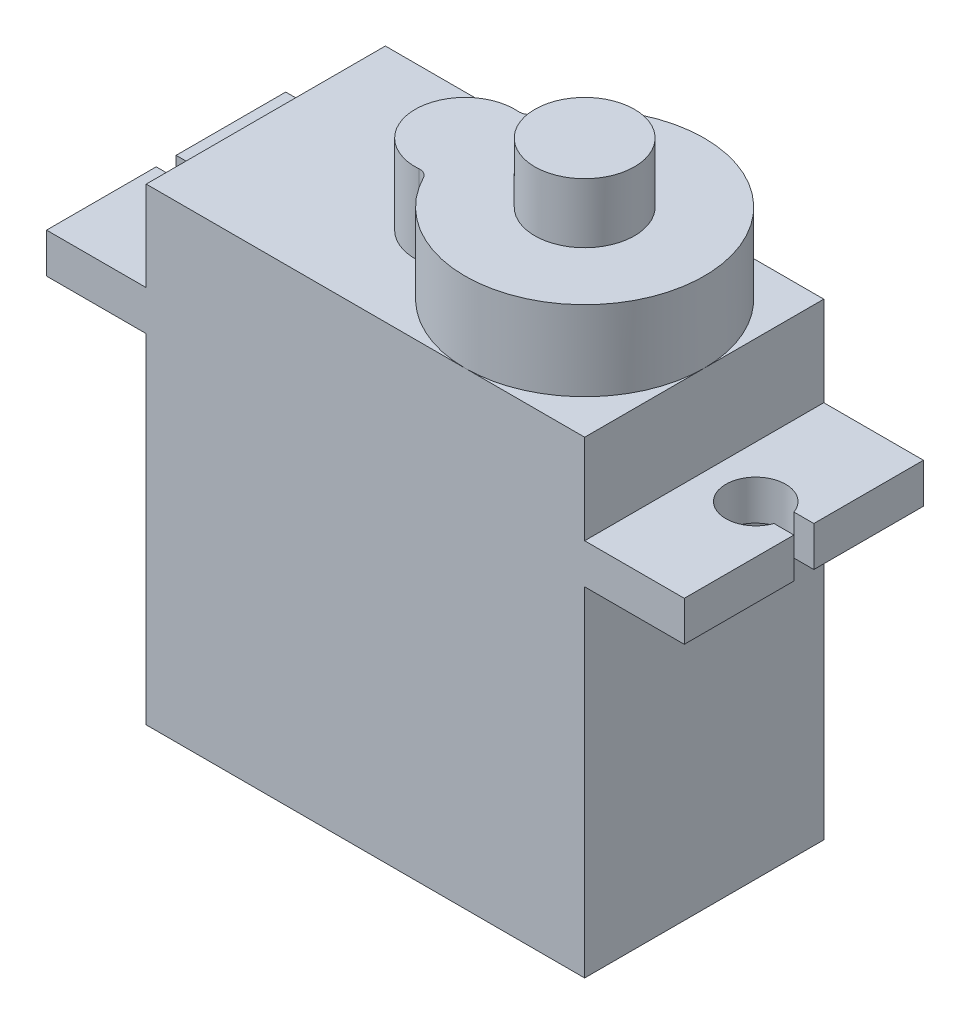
ISO-10303-21;
HEADER;
FILE_DESCRIPTION(('STEP AP214'),'2;1');
FILE_NAME('part.step','',(''),(''),'','','');
FILE_SCHEMA(('AUTOMOTIVE_DESIGN { 1 0 10303 214 1 1 1 1 }'));
ENDSEC;
DATA;
#1=APPLICATION_CONTEXT('core data for automotive mechanical design processes');
#2=APPLICATION_PROTOCOL_DEFINITION('international standard','automotive_design',2000,#1);
#3=PRODUCT_CONTEXT('',#1,'mechanical');
#4=PRODUCT('Part','Part','',(#3));
#5=PRODUCT_RELATED_PRODUCT_CATEGORY('part','',(#4));
#6=PRODUCT_DEFINITION_FORMATION('','',#4);
#7=PRODUCT_DEFINITION_CONTEXT('part definition',#1,'design');
#8=PRODUCT_DEFINITION('design','',#6,#7);
#9=PRODUCT_DEFINITION_SHAPE('','',#8);
#10=(LENGTH_UNIT() NAMED_UNIT(*) SI_UNIT(.MILLI.,.METRE.));
#11=(NAMED_UNIT(*) PLANE_ANGLE_UNIT() SI_UNIT($,.RADIAN.));
#12=(NAMED_UNIT(*) SI_UNIT($,.STERADIAN.) SOLID_ANGLE_UNIT());
#13=UNCERTAINTY_MEASURE_WITH_UNIT(LENGTH_MEASURE(1.E-05),#10,'distance_accuracy_value','');
#14=(GEOMETRIC_REPRESENTATION_CONTEXT(3) GLOBAL_UNCERTAINTY_ASSIGNED_CONTEXT((#13)) GLOBAL_UNIT_ASSIGNED_CONTEXT((#10,
#11,#12)) REPRESENTATION_CONTEXT('',''));
#15=CARTESIAN_POINT('',(0.,0.,0.));
#16=DIRECTION('',(0.,0.,1.));
#17=DIRECTION('',(1.,0.,0.));
#18=AXIS2_PLACEMENT_3D('',#15,#16,#17);
#19=CARTESIAN_POINT('',(0.,23.5,0.));
#20=DIRECTION('',(0.,-1.,0.));
#21=DIRECTION('',(0.,0.,-1.));
#22=AXIS2_PLACEMENT_3D('',#19,#20,#21);
#23=PLANE('',#22);
#24=CARTESIAN_POINT('',(-0.770833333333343,23.5,2.99123430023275));
#25=DIRECTION('',(0.,-1.,0.));
#26=DIRECTION('',(0.,0.,-1.));
#27=AXIS2_PLACEMENT_3D('',#24,#25,#26);
#28=CIRCLE('',#27,0.5);
#29=CARTESIAN_POINT('',(-0.809027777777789,23.5,2.49269525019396));
#30=VERTEX_POINT('',#29);
#31=CARTESIAN_POINT('',(-0.326923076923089,23.5,2.761139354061));
#32=VERTEX_POINT('',#31);
#33=EDGE_CURVE('E50',#30,#32,#28,.T.);
#34=ORIENTED_EDGE('',*,*,#33,.F.);
#35=CARTESIAN_POINT('',(-1.00000000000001,23.5,0.));
#36=DIRECTION('',(0.,1.,0.));
#37=DIRECTION('',(0.,0.,1.));
#38=AXIS2_PLACEMENT_3D('',#35,#36,#37);
#39=CIRCLE('',#38,2.5);
#40=CARTESIAN_POINT('',(-0.809027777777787,23.5,-2.49269525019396));
#41=VERTEX_POINT('',#40);
#42=EDGE_CURVE('E54',#41,#30,#39,.T.);
#43=ORIENTED_EDGE('',*,*,#42,.F.);
#44=CARTESIAN_POINT('',(-0.770833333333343,23.5,-2.99123430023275));
#45=DIRECTION('',(0.,-1.,0.));
#46=DIRECTION('',(0.,0.,1.));
#47=AXIS2_PLACEMENT_3D('',#44,#45,#46);
#48=CIRCLE('',#47,0.5);
#49=CARTESIAN_POINT('',(-0.326923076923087,23.5,-2.761139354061));
#50=VERTEX_POINT('',#49);
#51=EDGE_CURVE('E427',#50,#41,#48,.T.);
#52=ORIENTED_EDGE('',*,*,#51,.F.);
#53=CARTESIAN_POINT('',(4.99999999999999,23.5,0.));
#54=DIRECTION('',(0.,1.,0.));
#55=DIRECTION('',(0.,0.,1.));
#56=AXIS2_PLACEMENT_3D('',#53,#54,#55);
#57=CIRCLE('',#56,6.);
#58=CARTESIAN_POINT('',(4.99999999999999,23.5,-6.));
#59=VERTEX_POINT('',#58);
#60=EDGE_CURVE('E373',#59,#50,#57,.T.);
#61=ORIENTED_EDGE('',*,*,#60,.F.);
#62=DIRECTION('',(-1.,0.,0.));
#63=VECTOR('',#62,1.);
#64=CARTESIAN_POINT('',(-11.,23.5,-6.));
#65=LINE('',#64,#63);
#66=CARTESIAN_POINT('',(-11.,23.5,-6.));
#67=VERTEX_POINT('',#66);
#68=EDGE_CURVE('E339',#59,#67,#65,.T.);
#69=ORIENTED_EDGE('',*,*,#68,.T.);
#70=DIRECTION('',(0.,0.,1.));
#71=VECTOR('',#70,1.);
#72=CARTESIAN_POINT('',(-11.,23.5,6.));
#73=LINE('',#72,#71);
#74=CARTESIAN_POINT('',(-11.,23.5,6.));
#75=VERTEX_POINT('',#74);
#76=EDGE_CURVE('E344',#67,#75,#73,.T.);
#77=ORIENTED_EDGE('',*,*,#76,.T.);
#78=DIRECTION('',(1.,0.,0.));
#79=VECTOR('',#78,1.);
#80=CARTESIAN_POINT('',(-11.,23.5,6.));
#81=LINE('',#80,#79);
#82=CARTESIAN_POINT('',(4.99999999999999,23.5,6.));
#83=VERTEX_POINT('',#82);
#84=EDGE_CURVE('E347',#75,#83,#81,.T.);
#85=ORIENTED_EDGE('',*,*,#84,.T.);
#86=EDGE_CURVE('E380',#32,#83,#57,.T.);
#87=ORIENTED_EDGE('',*,*,#86,.F.);
#88=EDGE_LOOP('',(#34,#43,#52,#61,#69,#77,#85,#87));
#89=FACE_BOUND('',#88,.T.);
#90=ADVANCED_FACE('F35',(#89),#23,.F.);
#91=CARTESIAN_POINT('',(11.,23.5,0.));
#92=VERTEX_POINT('',#91);
#93=EDGE_CURVE('E43',#83,#92,#57,.T.);
#94=ORIENTED_EDGE('',*,*,#93,.F.);
#95=CARTESIAN_POINT('',(11.,23.5,6.));
#96=VERTEX_POINT('',#95);
#97=EDGE_CURVE('E346',#83,#96,#81,.T.);
#98=ORIENTED_EDGE('',*,*,#97,.T.);
#99=DIRECTION('',(0.,0.,-1.));
#100=VECTOR('',#99,1.);
#101=CARTESIAN_POINT('',(11.,23.5,6.));
#102=LINE('',#101,#100);
#103=EDGE_CURVE('E336',#96,#92,#102,.T.);
#104=ORIENTED_EDGE('',*,*,#103,.T.);
#105=EDGE_LOOP('',(#94,#98,#104));
#106=FACE_BOUND('',#105,.T.);
#107=ADVANCED_FACE('F438',(#106),#23,.F.);
#108=CARTESIAN_POINT('',(11.,23.5,6.));
#109=DIRECTION('',(-1.,0.,0.));
#110=DIRECTION('',(0.,0.,1.));
#111=AXIS2_PLACEMENT_3D('',#108,#109,#110);
#112=PLANE('',#111);
#113=DIRECTION('',(0.,0.,1.));
#114=VECTOR('',#113,1.);
#115=CARTESIAN_POINT('',(11.,19.,0.));
#116=LINE('',#115,#114);
#117=CARTESIAN_POINT('',(11.,19.,-6.));
#118=VERTEX_POINT('',#117);
#119=CARTESIAN_POINT('',(11.,19.,6.));
#120=VERTEX_POINT('',#119);
#121=EDGE_CURVE('E249',#118,#120,#116,.T.);
#122=ORIENTED_EDGE('',*,*,#121,.F.);
#123=DIRECTION('',(0.,-1.,0.));
#124=VECTOR('',#123,1.);
#125=CARTESIAN_POINT('',(11.,23.5,-6.));
#126=LINE('',#125,#124);
#127=CARTESIAN_POINT('',(11.,23.5,-6.));
#128=VERTEX_POINT('',#127);
#129=EDGE_CURVE('E371',#128,#118,#126,.T.);
#130=ORIENTED_EDGE('',*,*,#129,.F.);
#131=EDGE_CURVE('E340',#92,#128,#102,.T.);
#132=ORIENTED_EDGE('',*,*,#131,.F.);
#133=ORIENTED_EDGE('',*,*,#103,.F.);
#134=DIRECTION('',(0.,-1.,0.));
#135=VECTOR('',#134,1.);
#136=CARTESIAN_POINT('',(11.,23.5,6.));
#137=LINE('',#136,#135);
#138=EDGE_CURVE('E362',#96,#120,#137,.T.);
#139=ORIENTED_EDGE('',*,*,#138,.T.);
#140=EDGE_LOOP('',(#122,#130,#132,#133,#139));
#141=FACE_BOUND('',#140,.T.);
#142=ADVANCED_FACE('F436',(#141),#112,.F.);
#143=CARTESIAN_POINT('',(-11.,23.5,6.));
#144=DIRECTION('',(1.,0.,0.));
#145=DIRECTION('',(0.,0.,-1.));
#146=AXIS2_PLACEMENT_3D('',#143,#144,#145);
#147=PLANE('',#146);
#148=DIRECTION('',(0.,0.,-1.));
#149=VECTOR('',#148,1.);
#150=CARTESIAN_POINT('',(-11.,19.,0.));
#151=LINE('',#150,#149);
#152=CARTESIAN_POINT('',(-11.,19.,6.));
#153=VERTEX_POINT('',#152);
#154=CARTESIAN_POINT('',(-11.,19.,-6.));
#155=VERTEX_POINT('',#154);
#156=EDGE_CURVE('E295',#153,#155,#151,.T.);
#157=ORIENTED_EDGE('',*,*,#156,.F.);
#158=DIRECTION('',(0.,-1.,0.));
#159=VECTOR('',#158,1.);
#160=CARTESIAN_POINT('',(-11.,23.5,6.));
#161=LINE('',#160,#159);
#162=EDGE_CURVE('E365',#75,#153,#161,.T.);
#163=ORIENTED_EDGE('',*,*,#162,.F.);
#164=ORIENTED_EDGE('',*,*,#76,.F.);
#165=DIRECTION('',(0.,-1.,0.));
#166=VECTOR('',#165,1.);
#167=CARTESIAN_POINT('',(-11.,23.5,-6.));
#168=LINE('',#167,#166);
#169=EDGE_CURVE('E369',#67,#155,#168,.T.);
#170=ORIENTED_EDGE('',*,*,#169,.T.);
#171=EDGE_LOOP('',(#157,#163,#164,#170));
#172=FACE_BOUND('',#171,.T.);
#173=ADVANCED_FACE('F421',(#172),#147,.F.);
#174=CARTESIAN_POINT('',(11.,17.,-6.));
#175=VERTEX_POINT('',#174);
#176=CARTESIAN_POINT('',(11.,0.,-6.));
#177=VERTEX_POINT('',#176);
#178=EDGE_CURVE('E370',#175,#177,#126,.T.);
#179=ORIENTED_EDGE('',*,*,#178,.F.);
#180=DIRECTION('',(0.,0.,1.));
#181=VECTOR('',#180,1.);
#182=CARTESIAN_POINT('',(11.,17.,0.));
#183=LINE('',#182,#181);
#184=CARTESIAN_POINT('',(11.,17.,6.));
#185=VERTEX_POINT('',#184);
#186=EDGE_CURVE('E264',#175,#185,#183,.T.);
#187=ORIENTED_EDGE('',*,*,#186,.T.);
#188=CARTESIAN_POINT('',(11.,0.,6.));
#189=VERTEX_POINT('',#188);
#190=EDGE_CURVE('E350',#185,#189,#137,.T.);
#191=ORIENTED_EDGE('',*,*,#190,.T.);
#192=DIRECTION('',(0.,0.,-1.));
#193=VECTOR('',#192,1.);
#194=CARTESIAN_POINT('',(11.,0.,6.));
#195=LINE('',#194,#193);
#196=EDGE_CURVE('E325',#189,#177,#195,.T.);
#197=ORIENTED_EDGE('',*,*,#196,.T.);
#198=EDGE_LOOP('',(#179,#187,#191,#197));
#199=FACE_BOUND('',#198,.T.);
#200=ADVANCED_FACE('F37',(#199),#112,.F.);
#201=CARTESIAN_POINT('',(-11.,23.5,-6.));
#202=DIRECTION('',(0.,0.,1.));
#203=DIRECTION('',(1.,0.,0.));
#204=AXIS2_PLACEMENT_3D('',#201,#202,#203);
#205=PLANE('',#204);
#206=DIRECTION('',(-1.,0.,0.));
#207=VECTOR('',#206,1.);
#208=CARTESIAN_POINT('',(-11.,0.,-6.));
#209=LINE('',#208,#207);
#210=CARTESIAN_POINT('',(-11.,0.,-6.));
#211=VERTEX_POINT('',#210);
#212=EDGE_CURVE('E353',#177,#211,#209,.T.);
#213=ORIENTED_EDGE('',*,*,#212,.T.);
#214=CARTESIAN_POINT('',(-11.,17.,-6.));
#215=VERTEX_POINT('',#214);
#216=EDGE_CURVE('E368',#215,#211,#168,.T.);
#217=ORIENTED_EDGE('',*,*,#216,.F.);
#218=DIRECTION('',(-1.,0.,0.));
#219=VECTOR('',#218,1.);
#220=CARTESIAN_POINT('',(0.,17.,-6.));
#221=LINE('',#220,#219);
#222=CARTESIAN_POINT('',(-16.,17.,-6.));
#223=VERTEX_POINT('',#222);
#224=EDGE_CURVE('E312',#215,#223,#221,.T.);
#225=ORIENTED_EDGE('',*,*,#224,.T.);
#226=DIRECTION('',(0.,-1.,0.));
#227=VECTOR('',#226,1.);
#228=CARTESIAN_POINT('',(-16.,19.,-6.));
#229=LINE('',#228,#227);
#230=CARTESIAN_POINT('',(-16.,19.,-6.));
#231=VERTEX_POINT('',#230);
#232=EDGE_CURVE('E330',#231,#223,#229,.T.);
#233=ORIENTED_EDGE('',*,*,#232,.F.);
#234=DIRECTION('',(-1.,0.,0.));
#235=VECTOR('',#234,1.);
#236=CARTESIAN_POINT('',(0.,19.,-6.));
#237=LINE('',#236,#235);
#238=EDGE_CURVE('E292',#155,#231,#237,.T.);
#239=ORIENTED_EDGE('',*,*,#238,.F.);
#240=ORIENTED_EDGE('',*,*,#169,.F.);
#241=ORIENTED_EDGE('',*,*,#68,.F.);
#242=EDGE_CURVE('E341',#128,#59,#65,.T.);
#243=ORIENTED_EDGE('',*,*,#242,.F.);
#244=ORIENTED_EDGE('',*,*,#129,.T.);
#245=DIRECTION('',(1.,0.,0.));
#246=VECTOR('',#245,1.);
#247=CARTESIAN_POINT('',(0.,19.,-6.00000000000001));
#248=LINE('',#247,#246);
#249=CARTESIAN_POINT('',(16.,19.,-6.));
#250=VERTEX_POINT('',#249);
#251=EDGE_CURVE('E252',#118,#250,#248,.T.);
#252=ORIENTED_EDGE('',*,*,#251,.T.);
#253=DIRECTION('',(0.,-1.,0.));
#254=VECTOR('',#253,1.);
#255=CARTESIAN_POINT('',(16.,19.,-6.));
#256=LINE('',#255,#254);
#257=CARTESIAN_POINT('',(16.,17.,-6.));
#258=VERTEX_POINT('',#257);
#259=EDGE_CURVE('E272',#250,#258,#256,.T.);
#260=ORIENTED_EDGE('',*,*,#259,.T.);
#261=DIRECTION('',(1.,0.,0.));
#262=VECTOR('',#261,1.);
#263=CARTESIAN_POINT('',(0.,17.,-6.00000000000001));
#264=LINE('',#263,#262);
#265=EDGE_CURVE('E266',#175,#258,#264,.T.);
#266=ORIENTED_EDGE('',*,*,#265,.F.);
#267=ORIENTED_EDGE('',*,*,#178,.T.);
#268=EDGE_LOOP('',(#213,#217,#225,#233,#239,#240,#241,#243,#244,#252,#260,#266,#267));
#269=FACE_BOUND('',#268,.T.);
#270=ADVANCED_FACE('F383',(#269),#205,.F.);
#271=CARTESIAN_POINT('',(-11.,17.,6.));
#272=VERTEX_POINT('',#271);
#273=CARTESIAN_POINT('',(-11.,0.,6.));
#274=VERTEX_POINT('',#273);
#275=EDGE_CURVE('E364',#272,#274,#161,.T.);
#276=ORIENTED_EDGE('',*,*,#275,.F.);
#277=DIRECTION('',(0.,0.,-1.));
#278=VECTOR('',#277,1.);
#279=CARTESIAN_POINT('',(-11.,17.,0.));
#280=LINE('',#279,#278);
#281=EDGE_CURVE('E316',#272,#215,#280,.T.);
#282=ORIENTED_EDGE('',*,*,#281,.T.);
#283=ORIENTED_EDGE('',*,*,#216,.T.);
#284=DIRECTION('',(0.,0.,1.));
#285=VECTOR('',#284,1.);
#286=CARTESIAN_POINT('',(-11.,0.,6.));
#287=LINE('',#286,#285);
#288=EDGE_CURVE('E356',#211,#274,#287,.T.);
#289=ORIENTED_EDGE('',*,*,#288,.T.);
#290=EDGE_LOOP('',(#276,#282,#283,#289));
#291=FACE_BOUND('',#290,.T.);
#292=ADVANCED_FACE('F399',(#291),#147,.F.);
#293=CARTESIAN_POINT('',(-11.,23.5,6.));
#294=DIRECTION('',(0.,0.,-1.));
#295=DIRECTION('',(-1.,0.,0.));
#296=AXIS2_PLACEMENT_3D('',#293,#294,#295);
#297=PLANE('',#296);
#298=DIRECTION('',(1.,0.,0.));
#299=VECTOR('',#298,1.);
#300=CARTESIAN_POINT('',(-11.,0.,6.));
#301=LINE('',#300,#299);
#302=EDGE_CURVE('E359',#274,#189,#301,.T.);
#303=ORIENTED_EDGE('',*,*,#302,.T.);
#304=ORIENTED_EDGE('',*,*,#190,.F.);
#305=DIRECTION('',(1.,0.,0.));
#306=VECTOR('',#305,1.);
#307=CARTESIAN_POINT('',(0.,17.,6.));
#308=LINE('',#307,#306);
#309=CARTESIAN_POINT('',(16.,17.,6.));
#310=VERTEX_POINT('',#309);
#311=EDGE_CURVE('E262',#185,#310,#308,.T.);
#312=ORIENTED_EDGE('',*,*,#311,.T.);
#313=DIRECTION('',(0.,-1.,0.));
#314=VECTOR('',#313,1.);
#315=CARTESIAN_POINT('',(16.,19.,6.));
#316=LINE('',#315,#314);
#317=CARTESIAN_POINT('',(16.,19.,6.));
#318=VERTEX_POINT('',#317);
#319=EDGE_CURVE('E274',#318,#310,#316,.T.);
#320=ORIENTED_EDGE('',*,*,#319,.F.);
#321=DIRECTION('',(1.,0.,0.));
#322=VECTOR('',#321,1.);
#323=CARTESIAN_POINT('',(0.,19.,6.));
#324=LINE('',#323,#322);
#325=EDGE_CURVE('E246',#120,#318,#324,.T.);
#326=ORIENTED_EDGE('',*,*,#325,.F.);
#327=ORIENTED_EDGE('',*,*,#138,.F.);
#328=ORIENTED_EDGE('',*,*,#97,.F.);
#329=ORIENTED_EDGE('',*,*,#84,.F.);
#330=ORIENTED_EDGE('',*,*,#162,.T.);
#331=DIRECTION('',(-1.,0.,0.));
#332=VECTOR('',#331,1.);
#333=CARTESIAN_POINT('',(0.,19.,6.00000000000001));
#334=LINE('',#333,#332);
#335=CARTESIAN_POINT('',(-16.,19.,6.));
#336=VERTEX_POINT('',#335);
#337=EDGE_CURVE('E298',#153,#336,#334,.T.);
#338=ORIENTED_EDGE('',*,*,#337,.T.);
#339=DIRECTION('',(0.,-1.,0.));
#340=VECTOR('',#339,1.);
#341=CARTESIAN_POINT('',(-16.,19.,6.));
#342=LINE('',#341,#340);
#343=CARTESIAN_POINT('',(-16.,17.,6.));
#344=VERTEX_POINT('',#343);
#345=EDGE_CURVE('E328',#336,#344,#342,.T.);
#346=ORIENTED_EDGE('',*,*,#345,.T.);
#347=DIRECTION('',(-1.,0.,0.));
#348=VECTOR('',#347,1.);
#349=CARTESIAN_POINT('',(0.,17.,6.00000000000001));
#350=LINE('',#349,#348);
#351=EDGE_CURVE('E318',#272,#344,#350,.T.);
#352=ORIENTED_EDGE('',*,*,#351,.F.);
#353=ORIENTED_EDGE('',*,*,#275,.T.);
#354=EDGE_LOOP('',(#303,#304,#312,#320,#326,#327,#328,#329,#330,#338,#346,#352,#353));
#355=FACE_BOUND('',#354,.T.);
#356=ADVANCED_FACE('F395',(#355),#297,.F.);
#357=EDGE_CURVE('E378',#92,#59,#57,.T.);
#358=ORIENTED_EDGE('',*,*,#357,.F.);
#359=ORIENTED_EDGE('',*,*,#131,.T.);
#360=ORIENTED_EDGE('',*,*,#242,.T.);
#361=EDGE_LOOP('',(#358,#359,#360));
#362=FACE_BOUND('',#361,.T.);
#363=ADVANCED_FACE('F433',(#362),#23,.F.);
#364=CARTESIAN_POINT('',(0.,0.,0.));
#365=DIRECTION('',(0.,-1.,0.));
#366=DIRECTION('',(0.,0.,-1.));
#367=AXIS2_PLACEMENT_3D('',#364,#365,#366);
#368=PLANE('',#367);
#369=ORIENTED_EDGE('',*,*,#196,.F.);
#370=ORIENTED_EDGE('',*,*,#302,.F.);
#371=ORIENTED_EDGE('',*,*,#288,.F.);
#372=ORIENTED_EDGE('',*,*,#212,.F.);
#373=EDGE_LOOP('',(#369,#370,#371,#372));
#374=FACE_BOUND('',#373,.T.);
#375=ADVANCED_FACE('F390',(#374),#368,.T.);
#376=CARTESIAN_POINT('',(-13.5857864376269,19.,0.));
#377=DIRECTION('',(0.,-1.,0.));
#378=DIRECTION('',(0.,0.,-1.));
#379=AXIS2_PLACEMENT_3D('',#376,#377,#378);
#380=CYLINDRICAL_SURFACE('',#379,1.5);
#381=CARTESIAN_POINT('',(-13.5857864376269,17.,0.));
#382=DIRECTION('',(0.,-1.,0.));
#383=DIRECTION('',(0.,0.,-1.));
#384=AXIS2_PLACEMENT_3D('',#381,#382,#383);
#385=CIRCLE('',#384,1.5);
#386=CARTESIAN_POINT('',(-15.,17.,-0.5));
#387=VERTEX_POINT('',#386);
#388=CARTESIAN_POINT('',(-15.,17.,0.5));
#389=VERTEX_POINT('',#388);
#390=EDGE_CURVE('E271',#387,#389,#385,.T.);
#391=ORIENTED_EDGE('',*,*,#390,.T.);
#392=DIRECTION('',(0.,-1.,0.));
#393=VECTOR('',#392,1.);
#394=CARTESIAN_POINT('',(-15.,19.,0.5));
#395=LINE('',#394,#393);
#396=CARTESIAN_POINT('',(-15.,19.,0.5));
#397=VERTEX_POINT('',#396);
#398=EDGE_CURVE('E323',#397,#389,#395,.T.);
#399=ORIENTED_EDGE('',*,*,#398,.F.);
#400=CARTESIAN_POINT('',(-13.5857864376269,19.,0.));
#401=DIRECTION('',(0.,-1.,0.));
#402=DIRECTION('',(0.,0.,-1.));
#403=AXIS2_PLACEMENT_3D('',#400,#401,#402);
#404=CIRCLE('',#403,1.5);
#405=CARTESIAN_POINT('',(-15.,19.,-0.5));
#406=VERTEX_POINT('',#405);
#407=EDGE_CURVE('E284',#406,#397,#404,.T.);
#408=ORIENTED_EDGE('',*,*,#407,.F.);
#409=DIRECTION('',(0.,-1.,0.));
#410=VECTOR('',#409,1.);
#411=CARTESIAN_POINT('',(-15.,19.,-0.5));
#412=LINE('',#411,#410);
#413=EDGE_CURVE('E304',#406,#387,#412,.T.);
#414=ORIENTED_EDGE('',*,*,#413,.T.);
#415=EDGE_LOOP('',(#391,#399,#408,#414));
#416=FACE_BOUND('',#415,.T.);
#417=ADVANCED_FACE('F491',(#416),#380,.F.);
#418=CARTESIAN_POINT('',(0.,19.,0.5));
#419=DIRECTION('',(0.,0.,-1.));
#420=DIRECTION('',(-1.,0.,0.));
#421=AXIS2_PLACEMENT_3D('',#418,#419,#420);
#422=PLANE('',#421);
#423=DIRECTION('',(1.,0.,0.));
#424=VECTOR('',#423,1.);
#425=CARTESIAN_POINT('',(0.,17.,0.5));
#426=LINE('',#425,#424);
#427=CARTESIAN_POINT('',(-16.,17.,0.5));
#428=VERTEX_POINT('',#427);
#429=EDGE_CURVE('E287',#428,#389,#426,.T.);
#430=ORIENTED_EDGE('',*,*,#429,.F.);
#431=DIRECTION('',(0.,-1.,0.));
#432=VECTOR('',#431,1.);
#433=CARTESIAN_POINT('',(-16.,19.,0.5));
#434=LINE('',#433,#432);
#435=CARTESIAN_POINT('',(-16.,19.,0.5));
#436=VERTEX_POINT('',#435);
#437=EDGE_CURVE('E326',#436,#428,#434,.T.);
#438=ORIENTED_EDGE('',*,*,#437,.F.);
#439=DIRECTION('',(1.,0.,0.));
#440=VECTOR('',#439,1.);
#441=CARTESIAN_POINT('',(0.,19.,0.5));
#442=LINE('',#441,#440);
#443=EDGE_CURVE('E301',#436,#397,#442,.T.);
#444=ORIENTED_EDGE('',*,*,#443,.T.);
#445=ORIENTED_EDGE('',*,*,#398,.T.);
#446=EDGE_LOOP('',(#430,#438,#444,#445));
#447=FACE_BOUND('',#446,.T.);
#448=ADVANCED_FACE('F537',(#447),#422,.T.);
#449=CARTESIAN_POINT('',(-16.,19.,0.));
#450=DIRECTION('',(-1.,0.,0.));
#451=DIRECTION('',(0.,0.,1.));
#452=AXIS2_PLACEMENT_3D('',#449,#450,#451);
#453=PLANE('',#452);
#454=DIRECTION('',(0.,0.,-1.));
#455=VECTOR('',#454,1.);
#456=CARTESIAN_POINT('',(-16.,17.,0.));
#457=LINE('',#456,#455);
#458=EDGE_CURVE('E313',#344,#428,#457,.T.);
#459=ORIENTED_EDGE('',*,*,#458,.F.);
#460=ORIENTED_EDGE('',*,*,#345,.F.);
#461=DIRECTION('',(0.,0.,-1.));
#462=VECTOR('',#461,1.);
#463=CARTESIAN_POINT('',(-16.,19.,0.));
#464=LINE('',#463,#462);
#465=EDGE_CURVE('E293',#336,#436,#464,.T.);
#466=ORIENTED_EDGE('',*,*,#465,.T.);
#467=ORIENTED_EDGE('',*,*,#437,.T.);
#468=EDGE_LOOP('',(#459,#460,#466,#467));
#469=FACE_BOUND('',#468,.T.);
#470=ADVANCED_FACE('F547',(#469),#453,.T.);
#471=CARTESIAN_POINT('',(-16.,17.,-0.5));
#472=VERTEX_POINT('',#471);
#473=EDGE_CURVE('E309',#472,#223,#457,.T.);
#474=ORIENTED_EDGE('',*,*,#473,.F.);
#475=DIRECTION('',(0.,-1.,0.));
#476=VECTOR('',#475,1.);
#477=CARTESIAN_POINT('',(-16.,19.,-0.5));
#478=LINE('',#477,#476);
#479=CARTESIAN_POINT('',(-16.,19.,-0.5));
#480=VERTEX_POINT('',#479);
#481=EDGE_CURVE('E332',#480,#472,#478,.T.);
#482=ORIENTED_EDGE('',*,*,#481,.F.);
#483=EDGE_CURVE('E289',#480,#231,#464,.T.);
#484=ORIENTED_EDGE('',*,*,#483,.T.);
#485=ORIENTED_EDGE('',*,*,#232,.T.);
#486=EDGE_LOOP('',(#474,#482,#484,#485));
#487=FACE_BOUND('',#486,.T.);
#488=ADVANCED_FACE('F408',(#487),#453,.T.);
#489=CARTESIAN_POINT('',(0.,19.,-0.5));
#490=DIRECTION('',(0.,0.,-1.));
#491=DIRECTION('',(-1.,0.,0.));
#492=AXIS2_PLACEMENT_3D('',#489,#490,#491);
#493=PLANE('',#492);
#494=DIRECTION('',(1.,0.,0.));
#495=VECTOR('',#494,1.);
#496=CARTESIAN_POINT('',(0.,17.,-0.5));
#497=LINE('',#496,#495);
#498=EDGE_CURVE('E307',#472,#387,#497,.T.);
#499=ORIENTED_EDGE('',*,*,#498,.T.);
#500=ORIENTED_EDGE('',*,*,#413,.F.);
#501=DIRECTION('',(1.,0.,0.));
#502=VECTOR('',#501,1.);
#503=CARTESIAN_POINT('',(0.,19.,-0.5));
#504=LINE('',#503,#502);
#505=EDGE_CURVE('E286',#480,#406,#504,.T.);
#506=ORIENTED_EDGE('',*,*,#505,.F.);
#507=ORIENTED_EDGE('',*,*,#481,.T.);
#508=EDGE_LOOP('',(#499,#500,#506,#507));
#509=FACE_BOUND('',#508,.T.);
#510=ADVANCED_FACE('F566',(#509),#493,.F.);
#511=CARTESIAN_POINT('',(0.,19.,0.));
#512=DIRECTION('',(0.,-1.,0.));
#513=DIRECTION('',(0.,0.,-1.));
#514=AXIS2_PLACEMENT_3D('',#511,#512,#513);
#515=PLANE('',#514);
#516=ORIENTED_EDGE('',*,*,#407,.T.);
#517=ORIENTED_EDGE('',*,*,#443,.F.);
#518=ORIENTED_EDGE('',*,*,#465,.F.);
#519=ORIENTED_EDGE('',*,*,#337,.F.);
#520=ORIENTED_EDGE('',*,*,#156,.T.);
#521=ORIENTED_EDGE('',*,*,#238,.T.);
#522=ORIENTED_EDGE('',*,*,#483,.F.);
#523=ORIENTED_EDGE('',*,*,#505,.T.);
#524=EDGE_LOOP('',(#516,#517,#518,#519,#520,#521,#522,#523));
#525=FACE_BOUND('',#524,.T.);
#526=ADVANCED_FACE('F416',(#525),#515,.F.);
#527=CARTESIAN_POINT('',(0.,17.,0.));
#528=DIRECTION('',(0.,-1.,0.));
#529=DIRECTION('',(0.,0.,-1.));
#530=AXIS2_PLACEMENT_3D('',#527,#528,#529);
#531=PLANE('',#530);
#532=ORIENTED_EDGE('',*,*,#390,.F.);
#533=ORIENTED_EDGE('',*,*,#498,.F.);
#534=ORIENTED_EDGE('',*,*,#473,.T.);
#535=ORIENTED_EDGE('',*,*,#224,.F.);
#536=ORIENTED_EDGE('',*,*,#281,.F.);
#537=ORIENTED_EDGE('',*,*,#351,.T.);
#538=ORIENTED_EDGE('',*,*,#458,.T.);
#539=ORIENTED_EDGE('',*,*,#429,.T.);
#540=EDGE_LOOP('',(#532,#533,#534,#535,#536,#537,#538,#539));
#541=FACE_BOUND('',#540,.T.);
#542=ADVANCED_FACE('F404',(#541),#531,.T.);
#543=CARTESIAN_POINT('',(0.,19.,-0.499999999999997));
#544=DIRECTION('',(0.,0.,1.));
#545=DIRECTION('',(1.,0.,0.));
#546=AXIS2_PLACEMENT_3D('',#543,#544,#545);
#547=PLANE('',#546);
#548=DIRECTION('',(-1.,0.,0.));
#549=VECTOR('',#548,1.);
#550=CARTESIAN_POINT('',(0.,17.,-0.499999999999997));
#551=LINE('',#550,#549);
#552=CARTESIAN_POINT('',(16.,17.,-0.499999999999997));
#553=VERTEX_POINT('',#552);
#554=CARTESIAN_POINT('',(15.,17.,-0.499999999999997));
#555=VERTEX_POINT('',#554);
#556=EDGE_CURVE('E226',#553,#555,#551,.T.);
#557=ORIENTED_EDGE('',*,*,#556,.F.);
#558=DIRECTION('',(0.,-1.,0.));
#559=VECTOR('',#558,1.);
#560=CARTESIAN_POINT('',(16.,19.,-0.499999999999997));
#561=LINE('',#560,#559);
#562=CARTESIAN_POINT('',(16.,19.,-0.499999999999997));
#563=VERTEX_POINT('',#562);
#564=EDGE_CURVE('E269',#563,#553,#561,.T.);
#565=ORIENTED_EDGE('',*,*,#564,.F.);
#566=DIRECTION('',(-1.,0.,0.));
#567=VECTOR('',#566,1.);
#568=CARTESIAN_POINT('',(0.,19.,-0.499999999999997));
#569=LINE('',#568,#567);
#570=CARTESIAN_POINT('',(15.,19.,-0.499999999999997));
#571=VERTEX_POINT('',#570);
#572=EDGE_CURVE('E235',#563,#571,#569,.T.);
#573=ORIENTED_EDGE('',*,*,#572,.T.);
#574=DIRECTION('',(0.,-1.,0.));
#575=VECTOR('',#574,1.);
#576=CARTESIAN_POINT('',(15.,19.,-0.499999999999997));
#577=LINE('',#576,#575);
#578=EDGE_CURVE('E282',#571,#555,#577,.T.);
#579=ORIENTED_EDGE('',*,*,#578,.T.);
#580=EDGE_LOOP('',(#557,#565,#573,#579));
#581=FACE_BOUND('',#580,.T.);
#582=ADVANCED_FACE('F468',(#581),#547,.T.);
#583=CARTESIAN_POINT('',(16.,19.,0.));
#584=DIRECTION('',(-1.,0.,0.));
#585=DIRECTION('',(0.,0.,1.));
#586=AXIS2_PLACEMENT_3D('',#583,#584,#585);
#587=PLANE('',#586);
#588=DIRECTION('',(0.,0.,-1.));
#589=VECTOR('',#588,1.);
#590=CARTESIAN_POINT('',(16.,17.,0.));
#591=LINE('',#590,#589);
#592=EDGE_CURVE('E239',#553,#258,#591,.T.);
#593=ORIENTED_EDGE('',*,*,#592,.T.);
#594=ORIENTED_EDGE('',*,*,#259,.F.);
#595=DIRECTION('',(0.,0.,-1.));
#596=VECTOR('',#595,1.);
#597=CARTESIAN_POINT('',(16.,19.,0.));
#598=LINE('',#597,#596);
#599=EDGE_CURVE('E247',#563,#250,#598,.T.);
#600=ORIENTED_EDGE('',*,*,#599,.F.);
#601=ORIENTED_EDGE('',*,*,#564,.T.);
#602=EDGE_LOOP('',(#593,#594,#600,#601));
#603=FACE_BOUND('',#602,.T.);
#604=ADVANCED_FACE('F449',(#603),#587,.F.);
#605=CARTESIAN_POINT('',(16.,17.,0.500000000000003));
#606=VERTEX_POINT('',#605);
#607=EDGE_CURVE('E260',#310,#606,#591,.T.);
#608=ORIENTED_EDGE('',*,*,#607,.T.);
#609=DIRECTION('',(0.,-1.,0.));
#610=VECTOR('',#609,1.);
#611=CARTESIAN_POINT('',(16.,19.,0.500000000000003));
#612=LINE('',#611,#610);
#613=CARTESIAN_POINT('',(16.,19.,0.500000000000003));
#614=VERTEX_POINT('',#613);
#615=EDGE_CURVE('E277',#614,#606,#612,.T.);
#616=ORIENTED_EDGE('',*,*,#615,.F.);
#617=EDGE_CURVE('E244',#318,#614,#598,.T.);
#618=ORIENTED_EDGE('',*,*,#617,.F.);
#619=ORIENTED_EDGE('',*,*,#319,.T.);
#620=EDGE_LOOP('',(#608,#616,#618,#619));
#621=FACE_BOUND('',#620,.T.);
#622=ADVANCED_FACE('F457',(#621),#587,.F.);
#623=CARTESIAN_POINT('',(0.,19.,0.500000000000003));
#624=DIRECTION('',(0.,0.,1.));
#625=DIRECTION('',(1.,0.,0.));
#626=AXIS2_PLACEMENT_3D('',#623,#624,#625);
#627=PLANE('',#626);
#628=DIRECTION('',(-1.,0.,0.));
#629=VECTOR('',#628,1.);
#630=CARTESIAN_POINT('',(0.,17.,0.500000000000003));
#631=LINE('',#630,#629);
#632=CARTESIAN_POINT('',(15.,17.,0.500000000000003));
#633=VERTEX_POINT('',#632);
#634=EDGE_CURVE('E257',#606,#633,#631,.T.);
#635=ORIENTED_EDGE('',*,*,#634,.T.);
#636=DIRECTION('',(0.,-1.,0.));
#637=VECTOR('',#636,1.);
#638=CARTESIAN_POINT('',(15.,19.,0.500000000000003));
#639=LINE('',#638,#637);
#640=CARTESIAN_POINT('',(15.,19.,0.500000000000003));
#641=VERTEX_POINT('',#640);
#642=EDGE_CURVE('E280',#641,#633,#639,.T.);
#643=ORIENTED_EDGE('',*,*,#642,.F.);
#644=DIRECTION('',(-1.,0.,0.));
#645=VECTOR('',#644,1.);
#646=CARTESIAN_POINT('',(0.,19.,0.500000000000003));
#647=LINE('',#646,#645);
#648=EDGE_CURVE('E242',#614,#641,#647,.T.);
#649=ORIENTED_EDGE('',*,*,#648,.F.);
#650=ORIENTED_EDGE('',*,*,#615,.T.);
#651=EDGE_LOOP('',(#635,#643,#649,#650));
#652=FACE_BOUND('',#651,.T.);
#653=ADVANCED_FACE('F463',(#652),#627,.F.);
#654=CARTESIAN_POINT('',(13.5857864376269,19.,0.));
#655=DIRECTION('',(0.,-1.,0.));
#656=DIRECTION('',(0.,0.,-1.));
#657=AXIS2_PLACEMENT_3D('',#654,#655,#656);
#658=CYLINDRICAL_SURFACE('',#657,1.5);
#659=CARTESIAN_POINT('',(13.5857864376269,17.,0.));
#660=DIRECTION('',(0.,-1.,0.));
#661=DIRECTION('',(0.,0.,-1.));
#662=AXIS2_PLACEMENT_3D('',#659,#660,#661);
#663=CIRCLE('',#662,1.5);
#664=EDGE_CURVE('E229',#555,#633,#663,.F.);
#665=ORIENTED_EDGE('',*,*,#664,.F.);
#666=ORIENTED_EDGE('',*,*,#578,.F.);
#667=CARTESIAN_POINT('',(13.5857864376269,19.,0.));
#668=DIRECTION('',(0.,-1.,0.));
#669=DIRECTION('',(0.,0.,-1.));
#670=AXIS2_PLACEMENT_3D('',#667,#668,#669);
#671=CIRCLE('',#670,1.5);
#672=EDGE_CURVE('E238',#571,#641,#671,.F.);
#673=ORIENTED_EDGE('',*,*,#672,.T.);
#674=ORIENTED_EDGE('',*,*,#642,.T.);
#675=EDGE_LOOP('',(#665,#666,#673,#674));
#676=FACE_BOUND('',#675,.T.);
#677=ADVANCED_FACE('F466',(#676),#658,.F.);
#678=CARTESIAN_POINT('',(0.,19.,0.));
#679=DIRECTION('',(0.,-1.,0.));
#680=DIRECTION('',(0.,0.,-1.));
#681=AXIS2_PLACEMENT_3D('',#678,#679,#680);
#682=PLANE('',#681);
#683=ORIENTED_EDGE('',*,*,#572,.F.);
#684=ORIENTED_EDGE('',*,*,#599,.T.);
#685=ORIENTED_EDGE('',*,*,#251,.F.);
#686=ORIENTED_EDGE('',*,*,#121,.T.);
#687=ORIENTED_EDGE('',*,*,#325,.T.);
#688=ORIENTED_EDGE('',*,*,#617,.T.);
#689=ORIENTED_EDGE('',*,*,#648,.T.);
#690=ORIENTED_EDGE('',*,*,#672,.F.);
#691=EDGE_LOOP('',(#683,#684,#685,#686,#687,#688,#689,#690));
#692=FACE_BOUND('',#691,.T.);
#693=ADVANCED_FACE('F443',(#692),#682,.F.);
#694=CARTESIAN_POINT('',(0.,17.,0.));
#695=DIRECTION('',(0.,-1.,0.));
#696=DIRECTION('',(0.,0.,-1.));
#697=AXIS2_PLACEMENT_3D('',#694,#695,#696);
#698=PLANE('',#697);
#699=ORIENTED_EDGE('',*,*,#556,.T.);
#700=ORIENTED_EDGE('',*,*,#664,.T.);
#701=ORIENTED_EDGE('',*,*,#634,.F.);
#702=ORIENTED_EDGE('',*,*,#607,.F.);
#703=ORIENTED_EDGE('',*,*,#311,.F.);
#704=ORIENTED_EDGE('',*,*,#186,.F.);
#705=ORIENTED_EDGE('',*,*,#265,.T.);
#706=ORIENTED_EDGE('',*,*,#592,.F.);
#707=EDGE_LOOP('',(#699,#700,#701,#702,#703,#704,#705,#706));
#708=FACE_BOUND('',#707,.T.);
#709=ADVANCED_FACE('F452',(#708),#698,.T.);
#710=CARTESIAN_POINT('',(-0.770833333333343,27.5,2.99123430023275));
#711=DIRECTION('',(0.,-1.,0.));
#712=DIRECTION('',(0.,0.,-1.));
#713=AXIS2_PLACEMENT_3D('',#710,#711,#712);
#714=CYLINDRICAL_SURFACE('',#713,0.5);
#715=ORIENTED_EDGE('',*,*,#33,.T.);
#716=DIRECTION('',(0.,-1.,0.));
#717=VECTOR('',#716,1.);
#718=CARTESIAN_POINT('',(-0.326923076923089,27.5,2.761139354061));
#719=LINE('',#718,#717);
#720=CARTESIAN_POINT('',(-0.326923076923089,27.5,2.761139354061));
#721=VERTEX_POINT('',#720);
#722=EDGE_CURVE('E208',#721,#32,#719,.T.);
#723=ORIENTED_EDGE('',*,*,#722,.F.);
#724=CARTESIAN_POINT('',(-0.770833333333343,27.5,2.99123430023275));
#725=DIRECTION('',(0.,-1.,0.));
#726=DIRECTION('',(0.,0.,-1.));
#727=AXIS2_PLACEMENT_3D('',#724,#725,#726);
#728=CIRCLE('',#727,0.5);
#729=CARTESIAN_POINT('',(-0.809027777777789,27.5,2.49269525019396));
#730=VERTEX_POINT('',#729);
#731=EDGE_CURVE('E215',#730,#721,#728,.T.);
#732=ORIENTED_EDGE('',*,*,#731,.F.);
#733=DIRECTION('',(0.,-1.,0.));
#734=VECTOR('',#733,1.);
#735=CARTESIAN_POINT('',(-0.809027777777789,27.5,2.49269525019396));
#736=LINE('',#735,#734);
#737=EDGE_CURVE('E717',#730,#30,#736,.T.);
#738=ORIENTED_EDGE('',*,*,#737,.T.);
#739=EDGE_LOOP('',(#715,#723,#732,#738));
#740=FACE_BOUND('',#739,.T.);
#741=ADVANCED_FACE('F225',(#740),#714,.F.);
#742=CARTESIAN_POINT('',(4.99999999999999,27.5,0.));
#743=DIRECTION('',(0.,-1.,0.));
#744=DIRECTION('',(0.,0.,-1.));
#745=AXIS2_PLACEMENT_3D('',#742,#743,#744);
#746=CYLINDRICAL_SURFACE('',#745,6.);
#747=ORIENTED_EDGE('',*,*,#86,.T.);
#748=ORIENTED_EDGE('',*,*,#93,.T.);
#749=ORIENTED_EDGE('',*,*,#357,.T.);
#750=ORIENTED_EDGE('',*,*,#60,.T.);
#751=DIRECTION('',(0.,-1.,0.));
#752=VECTOR('',#751,1.);
#753=CARTESIAN_POINT('',(-0.326923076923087,27.5,-2.761139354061));
#754=LINE('',#753,#752);
#755=CARTESIAN_POINT('',(-0.326923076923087,27.5,-2.761139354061));
#756=VERTEX_POINT('',#755);
#757=EDGE_CURVE('E211',#756,#50,#754,.T.);
#758=ORIENTED_EDGE('',*,*,#757,.F.);
#759=CARTESIAN_POINT('',(4.99999999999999,27.5,0.));
#760=DIRECTION('',(0.,1.,0.));
#761=DIRECTION('',(0.,0.,1.));
#762=AXIS2_PLACEMENT_3D('',#759,#760,#761);
#763=CIRCLE('',#762,6.);
#764=EDGE_CURVE('E203',#721,#756,#763,.T.);
#765=ORIENTED_EDGE('',*,*,#764,.F.);
#766=ORIENTED_EDGE('',*,*,#722,.T.);
#767=EDGE_LOOP('',(#747,#748,#749,#750,#758,#765,#766));
#768=FACE_BOUND('',#767,.T.);
#769=ADVANCED_FACE('F206',(#768),#746,.T.);
#770=CARTESIAN_POINT('',(-0.770833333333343,27.5,-2.99123430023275));
#771=DIRECTION('',(0.,-1.,0.));
#772=DIRECTION('',(0.,0.,-1.));
#773=AXIS2_PLACEMENT_3D('',#770,#771,#772);
#774=CYLINDRICAL_SURFACE('',#773,0.5);
#775=ORIENTED_EDGE('',*,*,#51,.T.);
#776=DIRECTION('',(0.,-1.,0.));
#777=VECTOR('',#776,1.);
#778=CARTESIAN_POINT('',(-0.809027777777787,27.5,-2.49269525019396));
#779=LINE('',#778,#777);
#780=CARTESIAN_POINT('',(-0.809027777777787,27.5,-2.49269525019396));
#781=VERTEX_POINT('',#780);
#782=EDGE_CURVE('E231',#781,#41,#779,.T.);
#783=ORIENTED_EDGE('',*,*,#782,.F.);
#784=CARTESIAN_POINT('',(-0.770833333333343,27.5,-2.99123430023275));
#785=DIRECTION('',(0.,-1.,0.));
#786=DIRECTION('',(0.,0.,1.));
#787=AXIS2_PLACEMENT_3D('',#784,#785,#786);
#788=CIRCLE('',#787,0.5);
#789=EDGE_CURVE('E214',#756,#781,#788,.T.);
#790=ORIENTED_EDGE('',*,*,#789,.F.);
#791=ORIENTED_EDGE('',*,*,#757,.T.);
#792=EDGE_LOOP('',(#775,#783,#790,#791));
#793=FACE_BOUND('',#792,.T.);
#794=ADVANCED_FACE('F660',(#793),#774,.F.);
#795=CARTESIAN_POINT('',(-1.00000000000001,27.5,0.));
#796=DIRECTION('',(0.,-1.,0.));
#797=DIRECTION('',(0.,0.,-1.));
#798=AXIS2_PLACEMENT_3D('',#795,#796,#797);
#799=CYLINDRICAL_SURFACE('',#798,2.5);
#800=ORIENTED_EDGE('',*,*,#42,.T.);
#801=ORIENTED_EDGE('',*,*,#737,.F.);
#802=CARTESIAN_POINT('',(-1.00000000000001,27.5,0.));
#803=DIRECTION('',(0.,1.,0.));
#804=DIRECTION('',(0.,0.,1.));
#805=AXIS2_PLACEMENT_3D('',#802,#803,#804);
#806=CIRCLE('',#805,2.5);
#807=EDGE_CURVE('E220',#781,#730,#806,.T.);
#808=ORIENTED_EDGE('',*,*,#807,.F.);
#809=ORIENTED_EDGE('',*,*,#782,.T.);
#810=EDGE_LOOP('',(#800,#801,#808,#809));
#811=FACE_BOUND('',#810,.T.);
#812=ADVANCED_FACE('F668',(#811),#799,.T.);
#813=CARTESIAN_POINT('',(2.11458333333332,27.5,1.49561715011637));
#814=DIRECTION('',(0.,-1.,0.));
#815=DIRECTION('',(0.,0.,-1.));
#816=AXIS2_PLACEMENT_3D('',#813,#814,#815);
#817=PLANE('',#816);
#818=CARTESIAN_POINT('',(4.99999999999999,27.5,0.));
#819=DIRECTION('',(0.,-1.,0.));
#820=DIRECTION('',(0.,0.,-1.));
#821=AXIS2_PLACEMENT_3D('',#818,#819,#820);
#822=CIRCLE('',#821,2.5);
#823=CARTESIAN_POINT('',(4.99999999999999,27.5,-2.5));
#824=VERTEX_POINT('',#823);
#825=EDGE_CURVE('E11',#824,#824,#822,.F.);
#826=ORIENTED_EDGE('',*,*,#825,.F.);
#827=EDGE_LOOP('',(#826));
#828=FACE_BOUND('',#827,.T.);
#829=ORIENTED_EDGE('',*,*,#731,.T.);
#830=ORIENTED_EDGE('',*,*,#764,.T.);
#831=ORIENTED_EDGE('',*,*,#789,.T.);
#832=ORIENTED_EDGE('',*,*,#807,.T.);
#833=EDGE_LOOP('',(#829,#830,#831,#832));
#834=FACE_BOUND('',#833,.T.);
#835=ADVANCED_FACE('F218',(#828,#834),#817,.F.);
#836=CARTESIAN_POINT('',(4.99999999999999,30.5,0.));
#837=DIRECTION('',(0.,-1.,0.));
#838=DIRECTION('',(0.,0.,-1.));
#839=AXIS2_PLACEMENT_3D('',#836,#837,#838);
#840=CYLINDRICAL_SURFACE('',#839,2.5);
#841=CARTESIAN_POINT('',(4.99999999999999,30.5,0.));
#842=DIRECTION('',(0.,1.,0.));
#843=DIRECTION('',(0.,0.,1.));
#844=AXIS2_PLACEMENT_3D('',#841,#842,#843);
#845=CIRCLE('',#844,2.5);
#846=CARTESIAN_POINT('',(4.99999999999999,30.5,2.5));
#847=VERTEX_POINT('',#846);
#848=EDGE_CURVE('E429',#847,#847,#845,.T.);
#849=ORIENTED_EDGE('',*,*,#848,.F.);
#850=EDGE_LOOP('',(#849));
#851=FACE_BOUND('',#850,.T.);
#852=ORIENTED_EDGE('',*,*,#825,.T.);
#853=EDGE_LOOP('',(#852));
#854=FACE_BOUND('',#853,.T.);
#855=ADVANCED_FACE('F685',(#851,#854),#840,.T.);
#856=CARTESIAN_POINT('',(4.99999999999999,30.5,0.));
#857=DIRECTION('',(0.,1.,0.));
#858=DIRECTION('',(0.,0.,1.));
#859=AXIS2_PLACEMENT_3D('',#856,#857,#858);
#860=PLANE('',#859);
#861=ORIENTED_EDGE('',*,*,#848,.T.);
#862=EDGE_LOOP('',(#861));
#863=FACE_BOUND('',#862,.T.);
#864=ADVANCED_FACE('F694',(#863),#860,.T.);
#865=CLOSED_SHELL('',(#90,#107,#142,#173,#200,#270,#292,#356,#363,#375,#417,#448,#470,#488,#510,
#526,#542,#582,#604,#622,#653,#677,#693,#709,#741,#769,#794,#812,#835,#855,#864));
#866=MANIFOLD_SOLID_BREP('B2',#865);
#867=ADVANCED_BREP_SHAPE_REPRESENTATION('',(#18,#866),#14);
#868=SHAPE_DEFINITION_REPRESENTATION(#9,#867);
ENDSEC;
END-ISO-10303-21;
